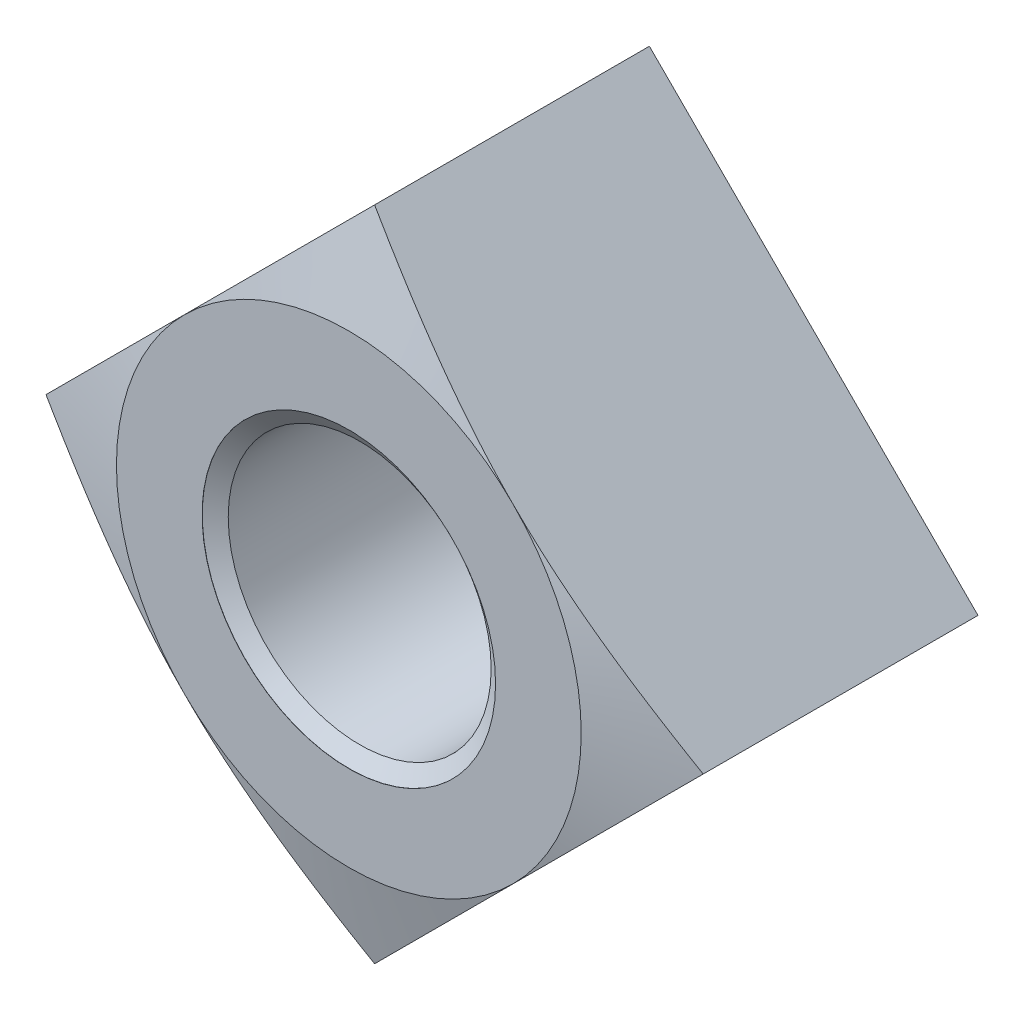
ISO-10303-21;
HEADER;
FILE_DESCRIPTION(('STEP AP214'),'2;1');
FILE_NAME('part.step','',(''),(''),'','','');
FILE_SCHEMA(('AUTOMOTIVE_DESIGN { 1 0 10303 214 1 1 1 1 }'));
ENDSEC;
DATA;
#1=APPLICATION_CONTEXT('core data for automotive mechanical design processes');
#2=APPLICATION_PROTOCOL_DEFINITION('international standard','automotive_design',2000,#1);
#3=PRODUCT_CONTEXT('',#1,'mechanical');
#4=PRODUCT('Part','Part','',(#3));
#5=PRODUCT_RELATED_PRODUCT_CATEGORY('part','',(#4));
#6=PRODUCT_DEFINITION_FORMATION('','',#4);
#7=PRODUCT_DEFINITION_CONTEXT('part definition',#1,'design');
#8=PRODUCT_DEFINITION('design','',#6,#7);
#9=PRODUCT_DEFINITION_SHAPE('','',#8);
#10=(LENGTH_UNIT() NAMED_UNIT(*) SI_UNIT(.MILLI.,.METRE.));
#11=(NAMED_UNIT(*) PLANE_ANGLE_UNIT() SI_UNIT($,.RADIAN.));
#12=(NAMED_UNIT(*) SI_UNIT($,.STERADIAN.) SOLID_ANGLE_UNIT());
#13=UNCERTAINTY_MEASURE_WITH_UNIT(LENGTH_MEASURE(1.E-05),#10,'distance_accuracy_value','');
#14=(GEOMETRIC_REPRESENTATION_CONTEXT(3) GLOBAL_UNCERTAINTY_ASSIGNED_CONTEXT((#13)) GLOBAL_UNIT_ASSIGNED_CONTEXT((#10,
#11,#12)) REPRESENTATION_CONTEXT('',''));
#15=CARTESIAN_POINT('',(0.,0.,0.));
#16=DIRECTION('',(0.,0.,1.));
#17=DIRECTION('',(1.,0.,0.));
#18=AXIS2_PLACEMENT_3D('',#15,#16,#17);
#19=CARTESIAN_POINT('',(0.,-42.6562165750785,-39.0144));
#20=DIRECTION('',(0.707106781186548,-0.707106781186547,0.));
#21=DIRECTION('',(0.707106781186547,0.707106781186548,0.));
#22=AXIS2_PLACEMENT_3D('',#19,#20,#21);
#23=PLANE('',#22);
#24=DIRECTION('',(0.,0.,1.));
#25=VECTOR('',#24,1.);
#26=CARTESIAN_POINT('',(42.6562165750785,0.,-39.0144));
#27=LINE('',#26,#25);
#28=CARTESIAN_POINT('',(42.6562165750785,0.,-39.0144));
#29=VERTEX_POINT('',#28);
#30=CARTESIAN_POINT('',(42.6562165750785,0.,-3.34768126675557));
#31=VERTEX_POINT('',#30);
#32=EDGE_CURVE('E179',#29,#31,#27,.T.);
#33=ORIENTED_EDGE('',*,*,#32,.T.);
#34=CARTESIAN_POINT('',(42.6564165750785,0.000200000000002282,-3.34773485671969));
#35=CARTESIAN_POINT('',(42.0162838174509,-0.639932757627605,-3.17624094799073));
#36=CARTESIAN_POINT('',(41.3756504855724,-1.28056608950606,-3.0084153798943));
#37=CARTESIAN_POINT('',(40.0932585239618,-2.5629580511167,-2.68135794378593));
#38=CARTESIAN_POINT('',(39.4514998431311,-3.20471673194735,-2.52212647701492));
#39=CARTESIAN_POINT('',(38.1663703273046,-4.48984624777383,-2.21342903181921));
#40=CARTESIAN_POINT('',(37.5229987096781,-5.13321786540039,-2.06396954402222));
#41=CARTESIAN_POINT('',(36.2349895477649,-6.42122702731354,-1.77641893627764));
#42=CARTESIAN_POINT('',(35.5903520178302,-7.06586455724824,-1.6383276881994));
#43=CARTESIAN_POINT('',(34.2990241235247,-8.35719245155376,-1.3750056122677));
#44=CARTESIAN_POINT('',(33.6523322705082,-9.00388430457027,-1.24978932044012));
#45=CARTESIAN_POINT('',(32.3575832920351,-10.2986332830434,-1.01417781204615));
#46=CARTESIAN_POINT('',(31.7095261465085,-10.94669042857,-0.90378281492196));
#47=CARTESIAN_POINT('',(30.4122133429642,-12.2440032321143,-0.699696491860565));
#48=CARTESIAN_POINT('',(29.7629579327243,-12.8932586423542,-0.606002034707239));
#49=CARTESIAN_POINT('',(28.4632570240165,-14.192959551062,-0.437132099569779));
#50=CARTESIAN_POINT('',(27.81281156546,-14.8434050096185,-0.361956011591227));
#51=CARTESIAN_POINT('',(26.5207414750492,-16.1354751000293,-0.232781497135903));
#52=CARTESIAN_POINT('',(25.87913208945,-16.7770844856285,-0.178480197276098));
#53=CARTESIAN_POINT('',(24.5951950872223,-18.0610214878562,-0.0907703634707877));
#54=CARTESIAN_POINT('',(23.9528674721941,-18.7033491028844,-0.0573617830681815));
#55=CARTESIAN_POINT('',(22.6678183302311,-19.9883982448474,-0.012299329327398));
#56=CARTESIAN_POINT('',(22.0250967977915,-20.631119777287,-0.00064576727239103));
#57=CARTESIAN_POINT('',(20.739643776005,-21.9165727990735,0.000593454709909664));
#58=CARTESIAN_POINT('',(20.0969122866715,-22.559304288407,-0.0098208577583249));
#59=CARTESIAN_POINT('',(18.8124636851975,-23.843752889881,-0.0524163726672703));
#60=CARTESIAN_POINT('',(18.1707462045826,-24.4854703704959,-0.0845755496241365));
#61=CARTESIAN_POINT('',(16.8880073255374,-25.7682092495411,-0.169807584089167));
#62=CARTESIAN_POINT('',(16.246985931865,-26.4092306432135,-0.222880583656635));
#63=CARTESIAN_POINT('',(14.9659220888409,-27.6902944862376,-0.348660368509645));
#64=CARTESIAN_POINT('',(14.3258796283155,-28.330336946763,-0.421366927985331));
#65=CARTESIAN_POINT('',(13.046947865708,-29.6092687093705,-0.584830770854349));
#66=CARTESIAN_POINT('',(12.4080585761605,-30.248157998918,-0.675588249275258));
#67=CARTESIAN_POINT('',(11.2779328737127,-31.3782837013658,-0.850724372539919));
#68=CARTESIAN_POINT('',(10.7864374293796,-31.8697791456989,-0.931792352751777));
#69=CARTESIAN_POINT('',(9.80425820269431,-32.8519583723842,-1.10279583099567));
#70=CARTESIAN_POINT('',(9.31357436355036,-33.3426422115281,-1.1927306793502));
#71=CARTESIAN_POINT('',(7.84255937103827,-34.8136572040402,-1.47465846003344));
#72=CARTESIAN_POINT('',(6.86337977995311,-35.7928367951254,-1.67875642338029));
#73=CARTESIAN_POINT('',(5.39372069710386,-37.2624958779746,-2.00536713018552));
#74=CARTESIAN_POINT('',(4.90212381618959,-37.7540927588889,-2.1180386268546));
#75=CARTESIAN_POINT('',(3.91963685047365,-38.7365797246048,-2.34939897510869));
#76=CARTESIAN_POINT('',(3.4287467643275,-39.227469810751,-2.46808781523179));
#77=CARTESIAN_POINT('',(2.44781617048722,-40.2084004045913,-2.71081913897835));
#78=CARTESIAN_POINT('',(1.95777541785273,-40.6984411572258,-2.8348596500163));
#79=CARTESIAN_POINT('',(0.978325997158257,-41.6778905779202,-3.08779288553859));
#80=CARTESIAN_POINT('',(0.48891732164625,-42.1672992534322,-3.21668555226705));
#81=CARTESIAN_POINT('',(-0.000200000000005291,-42.6564165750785,-3.34773485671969));
#82=B_SPLINE_CURVE_WITH_KNOTS('',3,(#34,#35,#36,#37,#38,#39,#40,#41,#42,#43,#44,#45,#46,#47,#48,
#49,#50,#51,#52,#53,#54,#55,#56,#57,#58,#59,#60,#61,#62,#63,#64,#65,#66,#67,#68,#69,#70,#71,#72,
#73,#74,#75,#76,#77,#78,#79,#80,#81),.UNSPECIFIED.,.F.,.F.,(4,2,2,2,2,2,2,2,2,2,2,2,2,2,2,2,2,2,
2,2,2,2,2,4),(0.,2.7641660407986,5.52846102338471,8.29457380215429,11.0606553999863,
13.8298264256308,16.5990384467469,19.3677307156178,22.1363317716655,24.8630930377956,
27.5898482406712,30.3166424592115,33.0434332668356,35.7674662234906,38.4915176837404,
41.2155378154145,43.9395873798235,46.0389010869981,48.1380610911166,52.3368720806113,
54.4497374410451,56.5625987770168,58.6746878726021,60.7867518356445),.UNSPECIFIED.);
#83=CARTESIAN_POINT('',(21.3281082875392,-21.3281082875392,0.));
#84=VERTEX_POINT('',#83);
#85=EDGE_CURVE('E62',#31,#84,#82,.T.);
#86=ORIENTED_EDGE('',*,*,#85,.T.);
#87=CARTESIAN_POINT('',(0.,-42.6562165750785,-3.34768126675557));
#88=VERTEX_POINT('',#87);
#89=EDGE_CURVE('E147',#84,#88,#82,.T.);
#90=ORIENTED_EDGE('',*,*,#89,.T.);
#91=DIRECTION('',(0.,0.,1.));
#92=VECTOR('',#91,1.);
#93=CARTESIAN_POINT('',(0.,-42.6562165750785,-39.0144));
#94=LINE('',#93,#92);
#95=CARTESIAN_POINT('',(0.,-42.6562165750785,-39.0144));
#96=VERTEX_POINT('',#95);
#97=EDGE_CURVE('E180',#96,#88,#94,.T.);
#98=ORIENTED_EDGE('',*,*,#97,.F.);
#99=DIRECTION('',(0.707106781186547,0.707106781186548,0.));
#100=VECTOR('',#99,1.);
#101=CARTESIAN_POINT('',(0.,-42.6562165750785,-39.0144));
#102=LINE('',#101,#100);
#103=EDGE_CURVE('E168',#96,#29,#102,.T.);
#104=ORIENTED_EDGE('',*,*,#103,.T.);
#105=EDGE_LOOP('',(#33,#86,#90,#98,#104));
#106=FACE_BOUND('',#105,.T.);
#107=ADVANCED_FACE('F39',(#106),#23,.T.);
#108=CARTESIAN_POINT('',(-42.6562165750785,0.,-39.0144));
#109=DIRECTION('',(-0.707106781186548,-0.707106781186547,0.));
#110=DIRECTION('',(0.707106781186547,-0.707106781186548,0.));
#111=AXIS2_PLACEMENT_3D('',#108,#109,#110);
#112=PLANE('',#111);
#113=ORIENTED_EDGE('',*,*,#97,.T.);
#114=CARTESIAN_POINT('',(0.000199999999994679,-42.6564165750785,-3.34773485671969));
#115=CARTESIAN_POINT('',(-0.639932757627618,-42.0162838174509,-3.17624094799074));
#116=CARTESIAN_POINT('',(-1.28056608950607,-41.3756504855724,-3.0084153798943));
#117=CARTESIAN_POINT('',(-2.56295805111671,-40.0932585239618,-2.68135794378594));
#118=CARTESIAN_POINT('',(-3.20471673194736,-39.4514998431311,-2.52212647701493));
#119=CARTESIAN_POINT('',(-4.48984624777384,-38.1663703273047,-2.21342903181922));
#120=CARTESIAN_POINT('',(-5.1332178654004,-37.5229987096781,-2.06396954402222));
#121=CARTESIAN_POINT('',(-6.42122702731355,-36.234989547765,-1.77641893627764));
#122=CARTESIAN_POINT('',(-7.06586455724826,-35.5903520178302,-1.63832768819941));
#123=CARTESIAN_POINT('',(-8.35719245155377,-34.2990241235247,-1.3750056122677));
#124=CARTESIAN_POINT('',(-9.00388430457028,-33.6523322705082,-1.24978932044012));
#125=CARTESIAN_POINT('',(-10.2986332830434,-32.3575832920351,-1.01417781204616));
#126=CARTESIAN_POINT('',(-10.94669042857,-31.7095261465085,-0.903782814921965));
#127=CARTESIAN_POINT('',(-12.2440032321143,-30.4122133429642,-0.69969649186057));
#128=CARTESIAN_POINT('',(-12.8932586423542,-29.7629579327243,-0.606002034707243));
#129=CARTESIAN_POINT('',(-14.192959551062,-28.4632570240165,-0.437132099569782));
#130=CARTESIAN_POINT('',(-14.8434050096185,-27.81281156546,-0.361956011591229));
#131=CARTESIAN_POINT('',(-16.1354751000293,-26.5207414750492,-0.232781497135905));
#132=CARTESIAN_POINT('',(-16.7770844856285,-25.87913208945,-0.178480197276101));
#133=CARTESIAN_POINT('',(-18.0610214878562,-24.5951950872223,-0.0907703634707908));
#134=CARTESIAN_POINT('',(-18.7033491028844,-23.9528674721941,-0.0573617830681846));
#135=CARTESIAN_POINT('',(-19.9883982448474,-22.6678183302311,-0.0122993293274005));
#136=CARTESIAN_POINT('',(-20.631119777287,-22.0250967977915,-0.000645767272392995));
#137=CARTESIAN_POINT('',(-21.9165727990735,-20.739643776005,0.00059345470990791));
#138=CARTESIAN_POINT('',(-22.559304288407,-20.0969122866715,-0.00982085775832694));
#139=CARTESIAN_POINT('',(-23.843752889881,-18.8124636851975,-0.0524163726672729));
#140=CARTESIAN_POINT('',(-24.4854703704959,-18.1707462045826,-0.0845755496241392));
#141=CARTESIAN_POINT('',(-25.7682092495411,-16.8880073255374,-0.169807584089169));
#142=CARTESIAN_POINT('',(-26.4092306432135,-16.246985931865,-0.222880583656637));
#143=CARTESIAN_POINT('',(-27.6902944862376,-14.9659220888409,-0.348660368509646));
#144=CARTESIAN_POINT('',(-28.330336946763,-14.3258796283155,-0.421366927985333));
#145=CARTESIAN_POINT('',(-29.6092687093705,-13.046947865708,-0.584830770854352));
#146=CARTESIAN_POINT('',(-30.248157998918,-12.4080585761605,-0.675588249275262));
#147=CARTESIAN_POINT('',(-31.3782837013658,-11.2779328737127,-0.850724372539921));
#148=CARTESIAN_POINT('',(-31.8697791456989,-10.7864374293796,-0.931792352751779));
#149=CARTESIAN_POINT('',(-32.8519583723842,-9.8042582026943,-1.10279583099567));
#150=CARTESIAN_POINT('',(-33.3426422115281,-9.31357436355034,-1.1927306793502));
#151=CARTESIAN_POINT('',(-34.8136572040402,-7.84255937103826,-1.47465846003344));
#152=CARTESIAN_POINT('',(-35.7928367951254,-6.8633797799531,-1.67875642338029));
#153=CARTESIAN_POINT('',(-37.2624958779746,-5.39372069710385,-2.00536713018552));
#154=CARTESIAN_POINT('',(-37.7540927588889,-4.90212381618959,-2.11803862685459));
#155=CARTESIAN_POINT('',(-38.7365797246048,-3.91963685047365,-2.34939897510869));
#156=CARTESIAN_POINT('',(-39.227469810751,-3.42874676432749,-2.46808781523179));
#157=CARTESIAN_POINT('',(-40.2084004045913,-2.44781617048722,-2.71081913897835));
#158=CARTESIAN_POINT('',(-40.6984411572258,-1.95777541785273,-2.8348596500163));
#159=CARTESIAN_POINT('',(-41.6778905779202,-0.978325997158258,-3.08779288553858));
#160=CARTESIAN_POINT('',(-42.1672992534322,-0.488917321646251,-3.21668555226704));
#161=CARTESIAN_POINT('',(-42.6564165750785,0.000200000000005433,-3.34773485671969));
#162=B_SPLINE_CURVE_WITH_KNOTS('',3,(#114,#115,#116,#117,#118,#119,#120,#121,#122,#123,#124,
#125,#126,#127,#128,#129,#130,#131,#132,#133,#134,#135,#136,#137,#138,#139,#140,#141,#142,#143,
#144,#145,#146,#147,#148,#149,#150,#151,#152,#153,#154,#155,#156,#157,#158,#159,#160,#161),
.UNSPECIFIED.,.F.,.F.,(4,2,2,2,2,2,2,2,2,2,2,2,2,2,2,2,2,2,2,2,2,2,2,4),(0.,2.7641660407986,
5.52846102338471,8.2945738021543,11.0606553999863,13.8298264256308,16.5990384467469,
19.3677307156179,22.1363317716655,24.8630930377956,27.5898482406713,30.3166424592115,
33.0434332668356,35.7674662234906,38.4915176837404,41.2155378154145,43.9395873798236,
46.0389010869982,48.1380610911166,52.3368720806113,54.4497374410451,56.5625987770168,
58.6746878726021,60.7867518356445),.UNSPECIFIED.);
#163=CARTESIAN_POINT('',(-21.3281082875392,-21.3281082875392,0.));
#164=VERTEX_POINT('',#163);
#165=EDGE_CURVE('E118',#88,#164,#162,.T.);
#166=ORIENTED_EDGE('',*,*,#165,.T.);
#167=CARTESIAN_POINT('',(-42.6562165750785,0.,-3.34768126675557));
#168=VERTEX_POINT('',#167);
#169=EDGE_CURVE('E105',#164,#168,#162,.T.);
#170=ORIENTED_EDGE('',*,*,#169,.T.);
#171=DIRECTION('',(0.,0.,1.));
#172=VECTOR('',#171,1.);
#173=CARTESIAN_POINT('',(-42.6562165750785,0.,-39.0144));
#174=LINE('',#173,#172);
#175=CARTESIAN_POINT('',(-42.6562165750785,0.,-39.0144));
#176=VERTEX_POINT('',#175);
#177=EDGE_CURVE('E117',#176,#168,#174,.T.);
#178=ORIENTED_EDGE('',*,*,#177,.F.);
#179=DIRECTION('',(0.707106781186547,-0.707106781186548,0.));
#180=VECTOR('',#179,1.);
#181=CARTESIAN_POINT('',(-42.6562165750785,0.,-39.0144));
#182=LINE('',#181,#180);
#183=EDGE_CURVE('E176',#176,#96,#182,.T.);
#184=ORIENTED_EDGE('',*,*,#183,.T.);
#185=EDGE_LOOP('',(#113,#166,#170,#178,#184));
#186=FACE_BOUND('',#185,.T.);
#187=ADVANCED_FACE('F211',(#186),#112,.T.);
#188=CARTESIAN_POINT('',(0.,42.6562165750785,-39.0144));
#189=DIRECTION('',(-0.707106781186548,0.707106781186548,0.));
#190=DIRECTION('',(-0.707106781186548,-0.707106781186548,0.));
#191=AXIS2_PLACEMENT_3D('',#188,#189,#190);
#192=PLANE('',#191);
#193=ORIENTED_EDGE('',*,*,#177,.T.);
#194=CARTESIAN_POINT('',(-42.6564165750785,-0.000199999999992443,-3.34773485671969));
#195=CARTESIAN_POINT('',(-42.0162838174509,0.639932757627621,-3.17624094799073));
#196=CARTESIAN_POINT('',(-41.3756504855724,1.28056608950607,-3.0084153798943));
#197=CARTESIAN_POINT('',(-40.0932585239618,2.56295805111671,-2.68135794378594));
#198=CARTESIAN_POINT('',(-39.4514998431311,3.20471673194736,-2.52212647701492));
#199=CARTESIAN_POINT('',(-38.1663703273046,4.48984624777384,-2.21342903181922));
#200=CARTESIAN_POINT('',(-37.5229987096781,5.13321786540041,-2.06396954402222));
#201=CARTESIAN_POINT('',(-36.2349895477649,6.42122702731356,-1.77641893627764));
#202=CARTESIAN_POINT('',(-35.5903520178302,7.06586455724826,-1.6383276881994));
#203=CARTESIAN_POINT('',(-34.2990241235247,8.35719245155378,-1.3750056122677));
#204=CARTESIAN_POINT('',(-33.6523322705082,9.00388430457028,-1.24978932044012));
#205=CARTESIAN_POINT('',(-32.3575832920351,10.2986332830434,-1.01417781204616));
#206=CARTESIAN_POINT('',(-31.7095261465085,10.94669042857,-0.903782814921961));
#207=CARTESIAN_POINT('',(-30.4122133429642,12.2440032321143,-0.699696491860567));
#208=CARTESIAN_POINT('',(-29.7629579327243,12.8932586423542,-0.606002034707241));
#209=CARTESIAN_POINT('',(-28.4632570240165,14.192959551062,-0.437132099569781));
#210=CARTESIAN_POINT('',(-27.81281156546,14.8434050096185,-0.361956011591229));
#211=CARTESIAN_POINT('',(-26.5207414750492,16.1354751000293,-0.232781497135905));
#212=CARTESIAN_POINT('',(-25.87913208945,16.7770844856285,-0.1784801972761));
#213=CARTESIAN_POINT('',(-24.5951950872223,18.0610214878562,-0.0907703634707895));
#214=CARTESIAN_POINT('',(-23.9528674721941,18.7033491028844,-0.0573617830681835));
#215=CARTESIAN_POINT('',(-22.6678183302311,19.9883982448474,-0.0122993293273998));
#216=CARTESIAN_POINT('',(-22.0250967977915,20.631119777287,-0.000645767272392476));
#217=CARTESIAN_POINT('',(-20.739643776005,21.9165727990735,0.00059345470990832));
#218=CARTESIAN_POINT('',(-20.0969122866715,22.559304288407,-0.00982085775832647));
#219=CARTESIAN_POINT('',(-18.8124636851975,23.843752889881,-0.0524163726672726));
#220=CARTESIAN_POINT('',(-18.1707462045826,24.4854703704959,-0.0845755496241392));
#221=CARTESIAN_POINT('',(-16.8880073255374,25.7682092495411,-0.169807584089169));
#222=CARTESIAN_POINT('',(-16.246985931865,26.4092306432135,-0.222880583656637));
#223=CARTESIAN_POINT('',(-14.9659220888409,27.6902944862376,-0.348660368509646));
#224=CARTESIAN_POINT('',(-14.3258796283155,28.330336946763,-0.421366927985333));
#225=CARTESIAN_POINT('',(-13.046947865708,29.6092687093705,-0.584830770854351));
#226=CARTESIAN_POINT('',(-12.4080585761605,30.248157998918,-0.67558824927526));
#227=CARTESIAN_POINT('',(-11.2779328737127,31.3782837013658,-0.850724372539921));
#228=CARTESIAN_POINT('',(-10.7864374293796,31.8697791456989,-0.931792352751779));
#229=CARTESIAN_POINT('',(-9.80425820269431,32.8519583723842,-1.10279583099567));
#230=CARTESIAN_POINT('',(-9.31357436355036,33.3426422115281,-1.1927306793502));
#231=CARTESIAN_POINT('',(-7.84255937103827,34.8136572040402,-1.47465846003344));
#232=CARTESIAN_POINT('',(-6.86337977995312,35.7928367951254,-1.6787564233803));
#233=CARTESIAN_POINT('',(-5.39372069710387,37.2624958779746,-2.00536713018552));
#234=CARTESIAN_POINT('',(-4.90212381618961,37.7540927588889,-2.1180386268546));
#235=CARTESIAN_POINT('',(-3.91963685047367,38.7365797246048,-2.34939897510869));
#236=CARTESIAN_POINT('',(-3.42874676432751,39.227469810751,-2.46808781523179));
#237=CARTESIAN_POINT('',(-2.44781617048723,40.2084004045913,-2.71081913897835));
#238=CARTESIAN_POINT('',(-1.95777541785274,40.6984411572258,-2.8348596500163));
#239=CARTESIAN_POINT('',(-0.97832599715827,41.6778905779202,-3.08779288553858));
#240=CARTESIAN_POINT('',(-0.488917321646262,42.1672992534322,-3.21668555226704));
#241=CARTESIAN_POINT('',(0.000199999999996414,42.6564165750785,-3.34773485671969));
#242=B_SPLINE_CURVE_WITH_KNOTS('',3,(#194,#195,#196,#197,#198,#199,#200,#201,#202,#203,#204,
#205,#206,#207,#208,#209,#210,#211,#212,#213,#214,#215,#216,#217,#218,#219,#220,#221,#222,#223,
#224,#225,#226,#227,#228,#229,#230,#231,#232,#233,#234,#235,#236,#237,#238,#239,#240,#241),
.UNSPECIFIED.,.F.,.F.,(4,2,2,2,2,2,2,2,2,2,2,2,2,2,2,2,2,2,2,2,2,2,2,4),(0.,2.7641660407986,
5.52846102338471,8.2945738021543,11.0606553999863,13.8298264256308,16.5990384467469,
19.3677307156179,22.1363317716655,24.8630930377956,27.5898482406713,30.3166424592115,
33.0434332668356,35.7674662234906,38.4915176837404,41.2155378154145,43.9395873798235,
46.0389010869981,48.1380610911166,52.3368720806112,54.4497374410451,56.5625987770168,
58.6746878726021,60.7867518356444),.UNSPECIFIED.);
#243=CARTESIAN_POINT('',(-21.3281082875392,21.3281082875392,0.));
#244=VERTEX_POINT('',#243);
#245=EDGE_CURVE('E100',#168,#244,#242,.T.);
#246=ORIENTED_EDGE('',*,*,#245,.T.);
#247=CARTESIAN_POINT('',(0.,42.6562165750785,-3.34768126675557));
#248=VERTEX_POINT('',#247);
#249=EDGE_CURVE('E92',#244,#248,#242,.T.);
#250=ORIENTED_EDGE('',*,*,#249,.T.);
#251=DIRECTION('',(0.,0.,1.));
#252=VECTOR('',#251,1.);
#253=CARTESIAN_POINT('',(0.,42.6562165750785,-39.0144));
#254=LINE('',#253,#252);
#255=CARTESIAN_POINT('',(0.,42.6562165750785,-39.0144));
#256=VERTEX_POINT('',#255);
#257=EDGE_CURVE('E184',#256,#248,#254,.T.);
#258=ORIENTED_EDGE('',*,*,#257,.F.);
#259=DIRECTION('',(-0.707106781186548,-0.707106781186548,0.));
#260=VECTOR('',#259,1.);
#261=CARTESIAN_POINT('',(0.,42.6562165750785,-39.0144));
#262=LINE('',#261,#260);
#263=EDGE_CURVE('E174',#256,#176,#262,.T.);
#264=ORIENTED_EDGE('',*,*,#263,.T.);
#265=EDGE_LOOP('',(#193,#246,#250,#258,#264));
#266=FACE_BOUND('',#265,.T.);
#267=ADVANCED_FACE('F115',(#266),#192,.T.);
#268=CARTESIAN_POINT('',(42.6562165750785,0.,-39.0144));
#269=DIRECTION('',(0.707106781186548,0.707106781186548,0.));
#270=DIRECTION('',(-0.707106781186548,0.707106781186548,0.));
#271=AXIS2_PLACEMENT_3D('',#268,#269,#270);
#272=PLANE('',#271);
#273=ORIENTED_EDGE('',*,*,#257,.T.);
#274=CARTESIAN_POINT('',(-0.000200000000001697,42.6564165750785,-3.34773485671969));
#275=CARTESIAN_POINT('',(0.639932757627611,42.0162838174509,-3.17624094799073));
#276=CARTESIAN_POINT('',(1.28056608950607,41.3756504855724,-3.0084153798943));
#277=CARTESIAN_POINT('',(2.56295805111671,40.0932585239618,-2.68135794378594));
#278=CARTESIAN_POINT('',(3.20471673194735,39.4514998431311,-2.52212647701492));
#279=CARTESIAN_POINT('',(4.48984624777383,38.1663703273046,-2.21342903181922));
#280=CARTESIAN_POINT('',(5.1332178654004,37.5229987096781,-2.06396954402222));
#281=CARTESIAN_POINT('',(6.42122702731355,36.2349895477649,-1.77641893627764));
#282=CARTESIAN_POINT('',(7.06586455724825,35.5903520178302,-1.63832768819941));
#283=CARTESIAN_POINT('',(8.35719245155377,34.2990241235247,-1.3750056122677));
#284=CARTESIAN_POINT('',(9.00388430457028,33.6523322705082,-1.24978932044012));
#285=CARTESIAN_POINT('',(10.2986332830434,32.3575832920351,-1.01417781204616));
#286=CARTESIAN_POINT('',(10.94669042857,31.7095261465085,-0.903782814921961));
#287=CARTESIAN_POINT('',(12.2440032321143,30.4122133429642,-0.699696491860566));
#288=CARTESIAN_POINT('',(12.8932586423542,29.7629579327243,-0.606002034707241));
#289=CARTESIAN_POINT('',(14.192959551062,28.4632570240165,-0.437132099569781));
#290=CARTESIAN_POINT('',(14.8434050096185,27.81281156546,-0.361956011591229));
#291=CARTESIAN_POINT('',(16.1354751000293,26.5207414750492,-0.232781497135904));
#292=CARTESIAN_POINT('',(16.7770844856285,25.87913208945,-0.178480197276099));
#293=CARTESIAN_POINT('',(18.0610214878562,24.5951950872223,-0.0907703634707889));
#294=CARTESIAN_POINT('',(18.7033491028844,23.9528674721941,-0.0573617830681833));
#295=CARTESIAN_POINT('',(19.9883982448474,22.6678183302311,-0.0122993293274));
#296=CARTESIAN_POINT('',(20.631119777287,22.0250967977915,-0.000645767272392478));
#297=CARTESIAN_POINT('',(21.9165727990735,20.739643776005,0.000593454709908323));
#298=CARTESIAN_POINT('',(22.559304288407,20.0969122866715,-0.00982085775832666));
#299=CARTESIAN_POINT('',(23.843752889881,18.8124636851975,-0.0524163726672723));
#300=CARTESIAN_POINT('',(24.4854703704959,18.1707462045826,-0.0845755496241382));
#301=CARTESIAN_POINT('',(25.7682092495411,16.8880073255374,-0.169807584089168));
#302=CARTESIAN_POINT('',(26.4092306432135,16.246985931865,-0.222880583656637));
#303=CARTESIAN_POINT('',(27.6902944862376,14.9659220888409,-0.348660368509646));
#304=CARTESIAN_POINT('',(28.330336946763,14.3258796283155,-0.421366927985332));
#305=CARTESIAN_POINT('',(29.6092687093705,13.046947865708,-0.58483077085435));
#306=CARTESIAN_POINT('',(30.248157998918,12.4080585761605,-0.675588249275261));
#307=CARTESIAN_POINT('',(31.3782837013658,11.2779328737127,-0.850724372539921));
#308=CARTESIAN_POINT('',(31.8697791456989,10.7864374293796,-0.931792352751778));
#309=CARTESIAN_POINT('',(32.8519583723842,9.80425820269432,-1.10279583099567));
#310=CARTESIAN_POINT('',(33.3426422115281,9.31357436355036,-1.1927306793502));
#311=CARTESIAN_POINT('',(34.8136572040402,7.84255937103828,-1.47465846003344));
#312=CARTESIAN_POINT('',(35.7928367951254,6.86337977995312,-1.67875642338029));
#313=CARTESIAN_POINT('',(37.2624958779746,5.39372069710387,-2.00536713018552));
#314=CARTESIAN_POINT('',(37.7540927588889,4.90212381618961,-2.11803862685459));
#315=CARTESIAN_POINT('',(38.7365797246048,3.91963685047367,-2.34939897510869));
#316=CARTESIAN_POINT('',(39.227469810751,3.42874676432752,-2.46808781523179));
#317=CARTESIAN_POINT('',(40.2084004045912,2.44781617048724,-2.71081913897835));
#318=CARTESIAN_POINT('',(40.6984411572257,1.95777541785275,-2.83485965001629));
#319=CARTESIAN_POINT('',(41.6778905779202,0.978325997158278,-3.08779288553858));
#320=CARTESIAN_POINT('',(42.1672992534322,0.488917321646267,-3.21668555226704));
#321=CARTESIAN_POINT('',(42.6564165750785,-0.000199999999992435,-3.34773485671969));
#322=B_SPLINE_CURVE_WITH_KNOTS('',3,(#274,#275,#276,#277,#278,#279,#280,#281,#282,#283,#284,
#285,#286,#287,#288,#289,#290,#291,#292,#293,#294,#295,#296,#297,#298,#299,#300,#301,#302,#303,
#304,#305,#306,#307,#308,#309,#310,#311,#312,#313,#314,#315,#316,#317,#318,#319,#320,#321),
.UNSPECIFIED.,.F.,.F.,(4,2,2,2,2,2,2,2,2,2,2,2,2,2,2,2,2,2,2,2,2,2,2,4),(0.,2.7641660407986,
5.52846102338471,8.2945738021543,11.0606553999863,13.8298264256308,16.5990384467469,
19.3677307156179,22.1363317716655,24.8630930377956,27.5898482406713,30.3166424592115,
33.0434332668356,35.7674662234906,38.4915176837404,41.2155378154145,43.9395873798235,
46.0389010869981,48.1380610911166,52.3368720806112,54.4497374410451,56.5625987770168,
58.6746878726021,60.7867518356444),.UNSPECIFIED.);
#323=CARTESIAN_POINT('',(21.3281082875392,21.3281082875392,0.));
#324=VERTEX_POINT('',#323);
#325=EDGE_CURVE('E96',#248,#324,#322,.T.);
#326=ORIENTED_EDGE('',*,*,#325,.T.);
#327=EDGE_CURVE('E112',#324,#31,#322,.T.);
#328=ORIENTED_EDGE('',*,*,#327,.T.);
#329=ORIENTED_EDGE('',*,*,#32,.F.);
#330=DIRECTION('',(-0.707106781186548,0.707106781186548,0.));
#331=VECTOR('',#330,1.);
#332=CARTESIAN_POINT('',(42.6562165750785,0.,-39.0144));
#333=LINE('',#332,#331);
#334=EDGE_CURVE('E171',#29,#256,#333,.T.);
#335=ORIENTED_EDGE('',*,*,#334,.T.);
#336=EDGE_LOOP('',(#273,#326,#328,#329,#335));
#337=FACE_BOUND('',#336,.T.);
#338=ADVANCED_FACE('F205',(#337),#272,.T.);
#339=CARTESIAN_POINT('',(42.6562165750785,0.,0.));
#340=DIRECTION('',(0.,0.,1.));
#341=DIRECTION('',(1.,0.,0.));
#342=AXIS2_PLACEMENT_3D('',#339,#340,#341);
#343=PLANE('',#342);
#344=CARTESIAN_POINT('',(0.,0.,0.));
#345=DIRECTION('',(0.,0.,1.));
#346=DIRECTION('',(1.,0.,0.));
#347=AXIS2_PLACEMENT_3D('',#344,#345,#346);
#348=CIRCLE('',#347,19.05);
#349=CARTESIAN_POINT('',(19.05,0.,0.));
#350=VERTEX_POINT('',#349);
#351=EDGE_CURVE('E161',#350,#350,#348,.T.);
#352=ORIENTED_EDGE('',*,*,#351,.F.);
#353=EDGE_LOOP('',(#352));
#354=FACE_BOUND('',#353,.T.);
#355=CARTESIAN_POINT('',(0.,0.,0.));
#356=DIRECTION('',(0.,0.,1.));
#357=DIRECTION('',(1.,0.,0.));
#358=AXIS2_PLACEMENT_3D('',#355,#356,#357);
#359=CIRCLE('',#358,30.1625);
#360=EDGE_CURVE('E43',#84,#324,#359,.T.);
#361=ORIENTED_EDGE('',*,*,#360,.T.);
#362=CARTESIAN_POINT('',(0.,0.,0.));
#363=DIRECTION('',(0.,0.,1.));
#364=DIRECTION('',(1.,0.,0.));
#365=AXIS2_PLACEMENT_3D('',#362,#363,#364);
#366=CIRCLE('',#365,30.1625);
#367=EDGE_CURVE('E55',#324,#244,#366,.T.);
#368=ORIENTED_EDGE('',*,*,#367,.T.);
#369=EDGE_CURVE('E11',#244,#164,#359,.T.);
#370=ORIENTED_EDGE('',*,*,#369,.T.);
#371=EDGE_CURVE('E48',#164,#84,#359,.T.);
#372=ORIENTED_EDGE('',*,*,#371,.T.);
#373=EDGE_LOOP('',(#361,#368,#370,#372));
#374=FACE_BOUND('',#373,.T.);
#375=ADVANCED_FACE('F111',(#354,#374),#343,.T.);
#376=CARTESIAN_POINT('',(0.,0.,-39.0144));
#377=DIRECTION('',(0.,0.,1.));
#378=DIRECTION('',(1.,0.,0.));
#379=AXIS2_PLACEMENT_3D('',#376,#377,#378);
#380=CYLINDRICAL_SURFACE('',#379,17.06626);
#381=CARTESIAN_POINT('',(0.,0.,-1.41137378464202));
#382=DIRECTION('',(0.,0.,1.));
#383=DIRECTION('',(1.,0.,0.));
#384=AXIS2_PLACEMENT_3D('',#381,#382,#383);
#385=CIRCLE('',#384,17.06626);
#386=CARTESIAN_POINT('',(17.06626,0.,-1.41137378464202));
#387=VERTEX_POINT('',#386);
#388=EDGE_CURVE('E167',#387,#387,#385,.F.);
#389=ORIENTED_EDGE('',*,*,#388,.F.);
#390=EDGE_LOOP('',(#389));
#391=FACE_BOUND('',#390,.T.);
#392=CARTESIAN_POINT('',(0.,0.,-37.603026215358));
#393=DIRECTION('',(0.,0.,-1.));
#394=DIRECTION('',(-1.,0.,0.));
#395=AXIS2_PLACEMENT_3D('',#392,#393,#394);
#396=CIRCLE('',#395,17.06626);
#397=CARTESIAN_POINT('',(-17.06626,0.,-37.603026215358));
#398=VERTEX_POINT('',#397);
#399=EDGE_CURVE('E160',#398,#398,#396,.F.);
#400=ORIENTED_EDGE('',*,*,#399,.F.);
#401=EDGE_LOOP('',(#400));
#402=FACE_BOUND('',#401,.T.);
#403=ADVANCED_FACE('F193',(#391,#402),#380,.F.);
#404=CARTESIAN_POINT('',(42.6562165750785,0.,-39.0144));
#405=DIRECTION('',(0.,0.,1.));
#406=DIRECTION('',(1.,0.,0.));
#407=AXIS2_PLACEMENT_3D('',#404,#405,#406);
#408=PLANE('',#407);
#409=CARTESIAN_POINT('',(0.,0.,-39.0144));
#410=DIRECTION('',(0.,0.,1.));
#411=DIRECTION('',(1.,0.,0.));
#412=AXIS2_PLACEMENT_3D('',#409,#410,#411);
#413=CIRCLE('',#412,19.05);
#414=CARTESIAN_POINT('',(19.05,0.,-39.0144));
#415=VERTEX_POINT('',#414);
#416=EDGE_CURVE('E157',#415,#415,#413,.T.);
#417=ORIENTED_EDGE('',*,*,#416,.T.);
#418=EDGE_LOOP('',(#417));
#419=FACE_BOUND('',#418,.T.);
#420=ORIENTED_EDGE('',*,*,#103,.F.);
#421=ORIENTED_EDGE('',*,*,#183,.F.);
#422=ORIENTED_EDGE('',*,*,#263,.F.);
#423=ORIENTED_EDGE('',*,*,#334,.F.);
#424=EDGE_LOOP('',(#420,#421,#422,#423));
#425=FACE_BOUND('',#424,.T.);
#426=ADVANCED_FACE('F195',(#419,#425),#408,.F.);
#427=CARTESIAN_POINT('',(0.,0.,-1.55022516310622));
#428=DIRECTION('',(0.,0.,1.));
#429=DIRECTION('',(1.,0.,0.));
#430=AXIS2_PLACEMENT_3D('',#427,#428,#429);
#431=CONICAL_SURFACE('',#430,16.867886,0.960105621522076);
#432=CARTESIAN_POINT('',(0.,0.,-0.0228599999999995));
#433=DIRECTION('',(0.,0.,1.));
#434=DIRECTION('',(1.,0.,0.));
#435=AXIS2_PLACEMENT_3D('',#432,#433,#434);
#436=CIRCLE('',#435,19.05);
#437=CARTESIAN_POINT('',(19.05,0.,-0.0228599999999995));
#438=VERTEX_POINT('',#437);
#439=EDGE_CURVE('E164',#438,#438,#436,.T.);
#440=ORIENTED_EDGE('',*,*,#439,.T.);
#441=EDGE_LOOP('',(#440));
#442=FACE_BOUND('',#441,.T.);
#443=ORIENTED_EDGE('',*,*,#388,.T.);
#444=EDGE_LOOP('',(#443));
#445=FACE_BOUND('',#444,.T.);
#446=ADVANCED_FACE('F201',(#442,#445),#431,.F.);
#447=CARTESIAN_POINT('',(0.,0.,-25.0375057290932));
#448=DIRECTION('',(0.,0.,1.));
#449=DIRECTION('',(1.,0.,0.));
#450=AXIS2_PLACEMENT_3D('',#447,#448,#449);
#451=CYLINDRICAL_SURFACE('',#450,19.05);
#452=ORIENTED_EDGE('',*,*,#351,.T.);
#453=EDGE_LOOP('',(#452));
#454=FACE_BOUND('',#453,.T.);
#455=ORIENTED_EDGE('',*,*,#439,.F.);
#456=EDGE_LOOP('',(#455));
#457=FACE_BOUND('',#456,.T.);
#458=ADVANCED_FACE('F235',(#454,#457),#451,.F.);
#459=CARTESIAN_POINT('',(0.,0.,-38.99154));
#460=DIRECTION('',(0.,0.,-1.));
#461=DIRECTION('',(-1.,0.,0.));
#462=AXIS2_PLACEMENT_3D('',#459,#460,#461);
#463=CONICAL_SURFACE('',#462,19.05,0.960105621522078);
#464=CARTESIAN_POINT('',(0.,0.,-38.99154));
#465=DIRECTION('',(0.,0.,1.));
#466=DIRECTION('',(1.,0.,0.));
#467=AXIS2_PLACEMENT_3D('',#464,#465,#466);
#468=CIRCLE('',#467,19.05);
#469=CARTESIAN_POINT('',(19.05,0.,-38.99154));
#470=VERTEX_POINT('',#469);
#471=EDGE_CURVE('E154',#470,#470,#468,.T.);
#472=ORIENTED_EDGE('',*,*,#471,.F.);
#473=EDGE_LOOP('',(#472));
#474=FACE_BOUND('',#473,.T.);
#475=ORIENTED_EDGE('',*,*,#399,.T.);
#476=EDGE_LOOP('',(#475));
#477=FACE_BOUND('',#476,.T.);
#478=ADVANCED_FACE('F142',(#474,#477),#463,.F.);
#479=CARTESIAN_POINT('',(0.,0.,-25.0375057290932));
#480=DIRECTION('',(0.,0.,1.));
#481=DIRECTION('',(1.,0.,0.));
#482=AXIS2_PLACEMENT_3D('',#479,#480,#481);
#483=CYLINDRICAL_SURFACE('',#482,19.05);
#484=ORIENTED_EDGE('',*,*,#471,.T.);
#485=EDGE_LOOP('',(#484));
#486=FACE_BOUND('',#485,.T.);
#487=ORIENTED_EDGE('',*,*,#416,.F.);
#488=EDGE_LOOP('',(#487));
#489=FACE_BOUND('',#488,.T.);
#490=ADVANCED_FACE('F227',(#486,#489),#483,.F.);
#491=CARTESIAN_POINT('',(0.,0.,0.));
#492=DIRECTION('',(0.,0.,-1.));
#493=DIRECTION('',(-1.,0.,0.));
#494=AXIS2_PLACEMENT_3D('',#491,#492,#493);
#495=CONICAL_SURFACE('',#494,30.1625,1.30899693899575);
#496=ORIENTED_EDGE('',*,*,#327,.F.);
#497=ORIENTED_EDGE('',*,*,#360,.F.);
#498=ORIENTED_EDGE('',*,*,#85,.F.);
#499=EDGE_LOOP('',(#496,#497,#498));
#500=FACE_BOUND('',#499,.T.);
#501=ADVANCED_FACE('F141',(#500),#495,.T.);
#502=ORIENTED_EDGE('',*,*,#371,.F.);
#503=ORIENTED_EDGE('',*,*,#165,.F.);
#504=ORIENTED_EDGE('',*,*,#89,.F.);
#505=EDGE_LOOP('',(#502,#503,#504));
#506=FACE_BOUND('',#505,.T.);
#507=ADVANCED_FACE('F225',(#506),#495,.T.);
#508=ORIENTED_EDGE('',*,*,#369,.F.);
#509=ORIENTED_EDGE('',*,*,#245,.F.);
#510=ORIENTED_EDGE('',*,*,#169,.F.);
#511=EDGE_LOOP('',(#508,#509,#510));
#512=FACE_BOUND('',#511,.T.);
#513=ADVANCED_FACE('F103',(#512),#495,.T.);
#514=ORIENTED_EDGE('',*,*,#367,.F.);
#515=ORIENTED_EDGE('',*,*,#325,.F.);
#516=ORIENTED_EDGE('',*,*,#249,.F.);
#517=EDGE_LOOP('',(#514,#515,#516));
#518=FACE_BOUND('',#517,.T.);
#519=ADVANCED_FACE('F94',(#518),#495,.T.);
#520=CLOSED_SHELL('',(#107,#187,#267,#338,#375,#403,#426,#446,#458,#478,#490,#501,#507,#513,#519));
#521=MANIFOLD_SOLID_BREP('B2',#520);
#522=ADVANCED_BREP_SHAPE_REPRESENTATION('',(#18,#521),#14);
#523=SHAPE_DEFINITION_REPRESENTATION(#9,#522);
ENDSEC;
END-ISO-10303-21;
